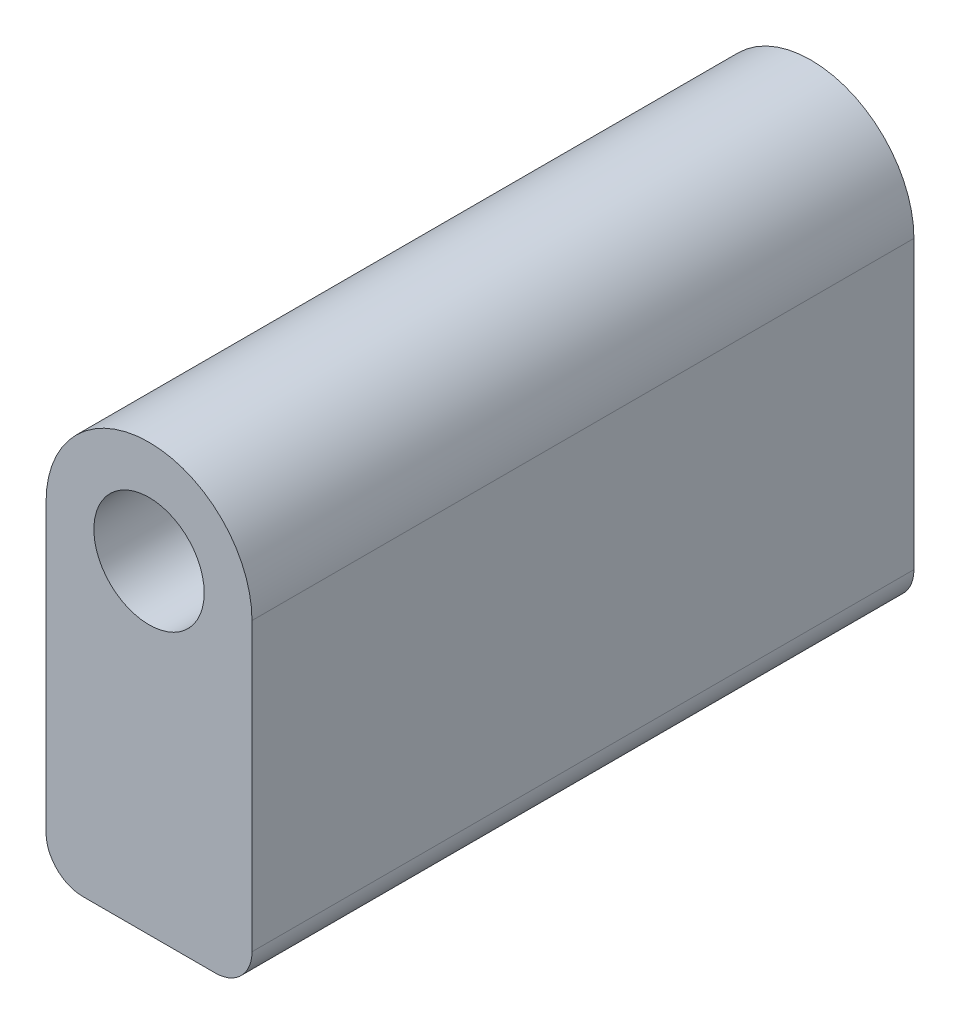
from build123d import *

# Parameters (mm, degrees)
SKETCH1_R           = 9.525
BOSS_EXTRUDE1_DEPTH = 114.3
FILLET1_R           = 6.35


with BuildPart() as part:
    # Sketch1 → Boss-Extrude1 (new body)
    # profile 1 of 4: a face of its own
    with BuildSketch(Plane.XY):
        with BuildLine():
            Line((-363.22, -158.75), (-363.22, -120.65))
            ThreePointArc((-363.22, -120.65), (-381, -102.87), (-398.78, -120.65))
            Line((-398.78, -120.65), (-398.78, -158.75))
            Line((-398.78, -158.75), (-363.22, -158.75))
        make_face()
        with Locations((-381, -120.65)):
            Circle(SKETCH1_R, mode=Mode.SUBTRACT)
    # profile 2 of 4: a face of its own
    with BuildSketch(Plane.XY):
        with BuildLine():
            ThreePointArc((-381, -176.53), (-368.427641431, -171.322358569), (-363.22, -158.75))
            Line((-363.22, -158.75), (-398.78, -158.75))
            ThreePointArc((-398.78, -158.75), (-393.572358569, -171.322358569), (-381, -176.53))
        make_face()
    # profile 3 of 4: a face of its own
    with BuildSketch(Plane.XY):
        with BuildLine():
            Line((-363.22, -176.53), (-363.22, -158.75))
            ThreePointArc((-363.22, -158.75), (-368.427641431, -171.322358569), (-381, -176.53))
            Line((-381, -176.53), (-363.22, -176.53))
        make_face()
    # profile 4 of 4: a face of its own
    with BuildSketch(Plane.XY):
        with BuildLine():
            ThreePointArc((-381, -176.53), (-393.572358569, -171.322358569), (-398.78, -158.75))
            Line((-398.78, -158.75), (-398.78, -176.53))
            Line((-398.78, -176.53), (-381, -176.53))
        make_face()
    extrude(amount=BOSS_EXTRUDE1_DEPTH)

    # Fillet1
    fillet1_edges = [part.edges().sort_by_distance(p)[0] for p in [
        (-398.78, -176.53, 57.15),
        (-363.22, -176.53, 57.15),
    ]]
    fillet(fillet1_edges, radius=FILLET1_R)


solid = part.part
